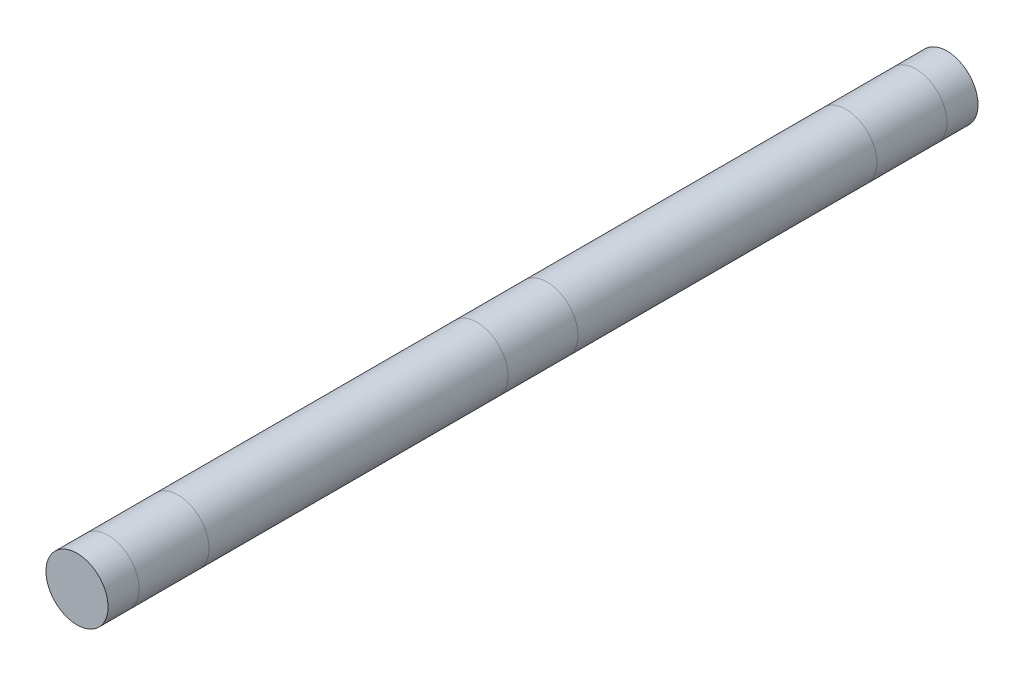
ISO-10303-21;
HEADER;
FILE_DESCRIPTION(('STEP AP214'),'2;1');
FILE_NAME('part.step','',(''),(''),'','','');
FILE_SCHEMA(('AUTOMOTIVE_DESIGN { 1 0 10303 214 1 1 1 1 }'));
ENDSEC;
DATA;
#1=APPLICATION_CONTEXT('core data for automotive mechanical design processes');
#2=APPLICATION_PROTOCOL_DEFINITION('international standard','automotive_design',2000,#1);
#3=PRODUCT_CONTEXT('',#1,'mechanical');
#4=PRODUCT('Part','Part','',(#3));
#5=PRODUCT_RELATED_PRODUCT_CATEGORY('part','',(#4));
#6=PRODUCT_DEFINITION_FORMATION('','',#4);
#7=PRODUCT_DEFINITION_CONTEXT('part definition',#1,'design');
#8=PRODUCT_DEFINITION('design','',#6,#7);
#9=PRODUCT_DEFINITION_SHAPE('','',#8);
#10=(LENGTH_UNIT() NAMED_UNIT(*) SI_UNIT(.MILLI.,.METRE.));
#11=(NAMED_UNIT(*) PLANE_ANGLE_UNIT() SI_UNIT($,.RADIAN.));
#12=(NAMED_UNIT(*) SI_UNIT($,.STERADIAN.) SOLID_ANGLE_UNIT());
#13=UNCERTAINTY_MEASURE_WITH_UNIT(LENGTH_MEASURE(1.E-05),#10,'distance_accuracy_value','');
#14=(GEOMETRIC_REPRESENTATION_CONTEXT(3) GLOBAL_UNCERTAINTY_ASSIGNED_CONTEXT((#13)) GLOBAL_UNIT_ASSIGNED_CONTEXT((#10,
#11,#12)) REPRESENTATION_CONTEXT('',''));
#15=CARTESIAN_POINT('',(0.,0.,0.));
#16=DIRECTION('',(0.,0.,1.));
#17=DIRECTION('',(1.,0.,0.));
#18=AXIS2_PLACEMENT_3D('',#15,#16,#17);
#19=CARTESIAN_POINT('',(0.,0.,711.2));
#20=DIRECTION('',(0.,0.,-1.));
#21=DIRECTION('',(-1.,0.,0.));
#22=AXIS2_PLACEMENT_3D('',#19,#20,#21);
#23=CYLINDRICAL_SURFACE('',#22,25.4);
#24=CARTESIAN_POINT('',(0.,0.,25.4));
#25=DIRECTION('',(0.,0.,-1.));
#26=DIRECTION('',(-1.,0.,0.));
#27=AXIS2_PLACEMENT_3D('',#24,#25,#26);
#28=CIRCLE('',#27,25.4);
#29=CARTESIAN_POINT('',(-25.4,0.,25.4));
#30=VERTEX_POINT('',#29);
#31=CARTESIAN_POINT('',(25.3999999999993,0.,25.4));
#32=VERTEX_POINT('',#31);
#33=EDGE_CURVE('E11',#30,#32,#28,.T.);
#34=ORIENTED_EDGE('',*,*,#33,.F.);
#35=EDGE_CURVE('E40',#32,#30,#28,.T.);
#36=ORIENTED_EDGE('',*,*,#35,.F.);
#37=DIRECTION('',(0.,0.,-1.));
#38=VECTOR('',#37,1.);
#39=CARTESIAN_POINT('',(25.3999999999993,0.,711.2));
#40=LINE('',#39,#38);
#41=CARTESIAN_POINT('',(25.3999999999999,0.,82.55));
#42=VERTEX_POINT('',#41);
#43=EDGE_CURVE('E140',#42,#32,#40,.T.);
#44=ORIENTED_EDGE('',*,*,#43,.F.);
#45=CARTESIAN_POINT('',(0.,0.,82.55));
#46=DIRECTION('',(0.,0.,1.));
#47=DIRECTION('',(1.,0.,0.));
#48=AXIS2_PLACEMENT_3D('',#45,#46,#47);
#49=CIRCLE('',#48,25.4);
#50=CARTESIAN_POINT('',(-25.4,0.,82.55));
#51=VERTEX_POINT('',#50);
#52=EDGE_CURVE('E136',#51,#42,#49,.T.);
#53=ORIENTED_EDGE('',*,*,#52,.F.);
#54=EDGE_CURVE('E139',#42,#51,#49,.T.);
#55=ORIENTED_EDGE('',*,*,#54,.F.);
#56=ORIENTED_EDGE('',*,*,#43,.T.);
#57=EDGE_LOOP('',(#34,#36,#44,#53,#55,#56));
#58=FACE_BOUND('',#57,.T.);
#59=ADVANCED_FACE('F36',(#58),#23,.T.);
#60=CARTESIAN_POINT('',(0.,0.,0.));
#61=DIRECTION('',(0.,0.,1.));
#62=DIRECTION('',(1.,0.,0.));
#63=AXIS2_PLACEMENT_3D('',#60,#61,#62);
#64=CIRCLE('',#63,25.4);
#65=CARTESIAN_POINT('',(25.4,0.,0.));
#66=VERTEX_POINT('',#65);
#67=EDGE_CURVE('E103',#66,#66,#64,.T.);
#68=ORIENTED_EDGE('',*,*,#67,.T.);
#69=EDGE_LOOP('',(#68));
#70=FACE_BOUND('',#69,.T.);
#71=ORIENTED_EDGE('',*,*,#35,.T.);
#72=ORIENTED_EDGE('',*,*,#33,.T.);
#73=EDGE_LOOP('',(#71,#72));
#74=FACE_BOUND('',#73,.T.);
#75=ADVANCED_FACE('F192',(#70,#74),#23,.T.);
#76=CARTESIAN_POINT('',(0.,0.,327.025));
#77=DIRECTION('',(0.,0.,-1.));
#78=DIRECTION('',(-1.,0.,0.));
#79=AXIS2_PLACEMENT_3D('',#76,#77,#78);
#80=CIRCLE('',#79,25.4);
#81=CARTESIAN_POINT('',(-25.4,0.,327.025));
#82=VERTEX_POINT('',#81);
#83=CARTESIAN_POINT('',(25.4,0.,327.025));
#84=VERTEX_POINT('',#83);
#85=EDGE_CURVE('E131',#82,#84,#80,.T.);
#86=ORIENTED_EDGE('',*,*,#85,.F.);
#87=EDGE_CURVE('E127',#84,#82,#80,.T.);
#88=ORIENTED_EDGE('',*,*,#87,.F.);
#89=DIRECTION('',(0.,0.,-1.));
#90=VECTOR('',#89,1.);
#91=CARTESIAN_POINT('',(25.4,0.,711.2));
#92=LINE('',#91,#90);
#93=CARTESIAN_POINT('',(25.3999999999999,0.,384.175));
#94=VERTEX_POINT('',#93);
#95=EDGE_CURVE('E123',#94,#84,#92,.T.);
#96=ORIENTED_EDGE('',*,*,#95,.F.);
#97=CARTESIAN_POINT('',(0.,0.,384.175));
#98=DIRECTION('',(0.,0.,1.));
#99=DIRECTION('',(1.,0.,0.));
#100=AXIS2_PLACEMENT_3D('',#97,#98,#99);
#101=CIRCLE('',#100,25.4);
#102=CARTESIAN_POINT('',(-25.4,0.,384.175));
#103=VERTEX_POINT('',#102);
#104=EDGE_CURVE('E118',#103,#94,#101,.T.);
#105=ORIENTED_EDGE('',*,*,#104,.F.);
#106=EDGE_CURVE('E122',#94,#103,#101,.T.);
#107=ORIENTED_EDGE('',*,*,#106,.F.);
#108=ORIENTED_EDGE('',*,*,#95,.T.);
#109=EDGE_LOOP('',(#86,#88,#96,#105,#107,#108));
#110=FACE_BOUND('',#109,.T.);
#111=ADVANCED_FACE('F155',(#110),#23,.T.);
#112=ORIENTED_EDGE('',*,*,#52,.T.);
#113=ORIENTED_EDGE('',*,*,#54,.T.);
#114=DIRECTION('',(0.,0.,-1.));
#115=VECTOR('',#114,1.);
#116=CARTESIAN_POINT('',(-25.4,0.,711.2));
#117=LINE('',#116,#115);
#118=EDGE_CURVE('E132',#82,#51,#117,.T.);
#119=ORIENTED_EDGE('',*,*,#118,.F.);
#120=ORIENTED_EDGE('',*,*,#85,.T.);
#121=ORIENTED_EDGE('',*,*,#87,.T.);
#122=ORIENTED_EDGE('',*,*,#118,.T.);
#123=EDGE_LOOP('',(#112,#113,#119,#120,#121,#122));
#124=FACE_BOUND('',#123,.T.);
#125=ADVANCED_FACE('F151',(#124),#23,.T.);
#126=CARTESIAN_POINT('',(0.,0.,628.65));
#127=DIRECTION('',(0.,0.,-1.));
#128=DIRECTION('',(-1.,0.,0.));
#129=AXIS2_PLACEMENT_3D('',#126,#127,#128);
#130=CIRCLE('',#129,25.4);
#131=CARTESIAN_POINT('',(-25.4,0.,628.65));
#132=VERTEX_POINT('',#131);
#133=CARTESIAN_POINT('',(25.4,0.,628.65));
#134=VERTEX_POINT('',#133);
#135=EDGE_CURVE('E113',#132,#134,#130,.T.);
#136=ORIENTED_EDGE('',*,*,#135,.F.);
#137=EDGE_CURVE('E109',#134,#132,#130,.T.);
#138=ORIENTED_EDGE('',*,*,#137,.F.);
#139=DIRECTION('',(0.,0.,-1.));
#140=VECTOR('',#139,1.);
#141=CARTESIAN_POINT('',(25.4,0.,711.2));
#142=LINE('',#141,#140);
#143=CARTESIAN_POINT('',(25.4,0.,685.8));
#144=VERTEX_POINT('',#143);
#145=EDGE_CURVE('E93',#144,#134,#142,.T.);
#146=ORIENTED_EDGE('',*,*,#145,.F.);
#147=CARTESIAN_POINT('',(0.,0.,685.8));
#148=DIRECTION('',(0.,0.,1.));
#149=DIRECTION('',(1.,0.,0.));
#150=AXIS2_PLACEMENT_3D('',#147,#148,#149);
#151=CIRCLE('',#150,25.4);
#152=CARTESIAN_POINT('',(-25.4,0.,685.8));
#153=VERTEX_POINT('',#152);
#154=EDGE_CURVE('E89',#153,#144,#151,.T.);
#155=ORIENTED_EDGE('',*,*,#154,.F.);
#156=EDGE_CURVE('E86',#144,#153,#151,.T.);
#157=ORIENTED_EDGE('',*,*,#156,.F.);
#158=ORIENTED_EDGE('',*,*,#145,.T.);
#159=EDGE_LOOP('',(#136,#138,#146,#155,#157,#158));
#160=FACE_BOUND('',#159,.T.);
#161=ADVANCED_FACE('F96',(#160),#23,.T.);
#162=ORIENTED_EDGE('',*,*,#104,.T.);
#163=ORIENTED_EDGE('',*,*,#106,.T.);
#164=DIRECTION('',(0.,0.,-1.));
#165=VECTOR('',#164,1.);
#166=CARTESIAN_POINT('',(-25.4,0.,711.2));
#167=LINE('',#166,#165);
#168=EDGE_CURVE('E114',#132,#103,#167,.T.);
#169=ORIENTED_EDGE('',*,*,#168,.F.);
#170=ORIENTED_EDGE('',*,*,#135,.T.);
#171=ORIENTED_EDGE('',*,*,#137,.T.);
#172=ORIENTED_EDGE('',*,*,#168,.T.);
#173=EDGE_LOOP('',(#162,#163,#169,#170,#171,#172));
#174=FACE_BOUND('',#173,.T.);
#175=ADVANCED_FACE('F160',(#174),#23,.T.);
#176=ORIENTED_EDGE('',*,*,#154,.T.);
#177=ORIENTED_EDGE('',*,*,#156,.T.);
#178=EDGE_LOOP('',(#176,#177));
#179=FACE_BOUND('',#178,.T.);
#180=CARTESIAN_POINT('',(0.,0.,711.2));
#181=DIRECTION('',(0.,0.,1.));
#182=DIRECTION('',(1.,0.,0.));
#183=AXIS2_PLACEMENT_3D('',#180,#181,#182);
#184=CIRCLE('',#183,25.4);
#185=CARTESIAN_POINT('',(25.4,0.,711.2));
#186=VERTEX_POINT('',#185);
#187=EDGE_CURVE('E99',#186,#186,#184,.T.);
#188=ORIENTED_EDGE('',*,*,#187,.F.);
#189=EDGE_LOOP('',(#188));
#190=FACE_BOUND('',#189,.T.);
#191=ADVANCED_FACE('F38',(#179,#190),#23,.T.);
#192=CARTESIAN_POINT('',(0.,0.,711.2));
#193=DIRECTION('',(0.,0.,1.));
#194=DIRECTION('',(1.,0.,0.));
#195=AXIS2_PLACEMENT_3D('',#192,#193,#194);
#196=PLANE('',#195);
#197=ORIENTED_EDGE('',*,*,#187,.T.);
#198=EDGE_LOOP('',(#197));
#199=FACE_BOUND('',#198,.T.);
#200=ADVANCED_FACE('F190',(#199),#196,.T.);
#201=CARTESIAN_POINT('',(0.,0.,0.));
#202=DIRECTION('',(0.,0.,1.));
#203=DIRECTION('',(1.,0.,0.));
#204=AXIS2_PLACEMENT_3D('',#201,#202,#203);
#205=PLANE('',#204);
#206=ORIENTED_EDGE('',*,*,#67,.F.);
#207=EDGE_LOOP('',(#206));
#208=FACE_BOUND('',#207,.T.);
#209=ADVANCED_FACE('F203',(#208),#205,.F.);
#210=CLOSED_SHELL('',(#59,#75,#111,#125,#161,#175,#191,#200,#209));
#211=MANIFOLD_SOLID_BREP('B2',#210);
#212=ADVANCED_BREP_SHAPE_REPRESENTATION('',(#18,#211),#14);
#213=SHAPE_DEFINITION_REPRESENTATION(#9,#212);
ENDSEC;
END-ISO-10303-21;
